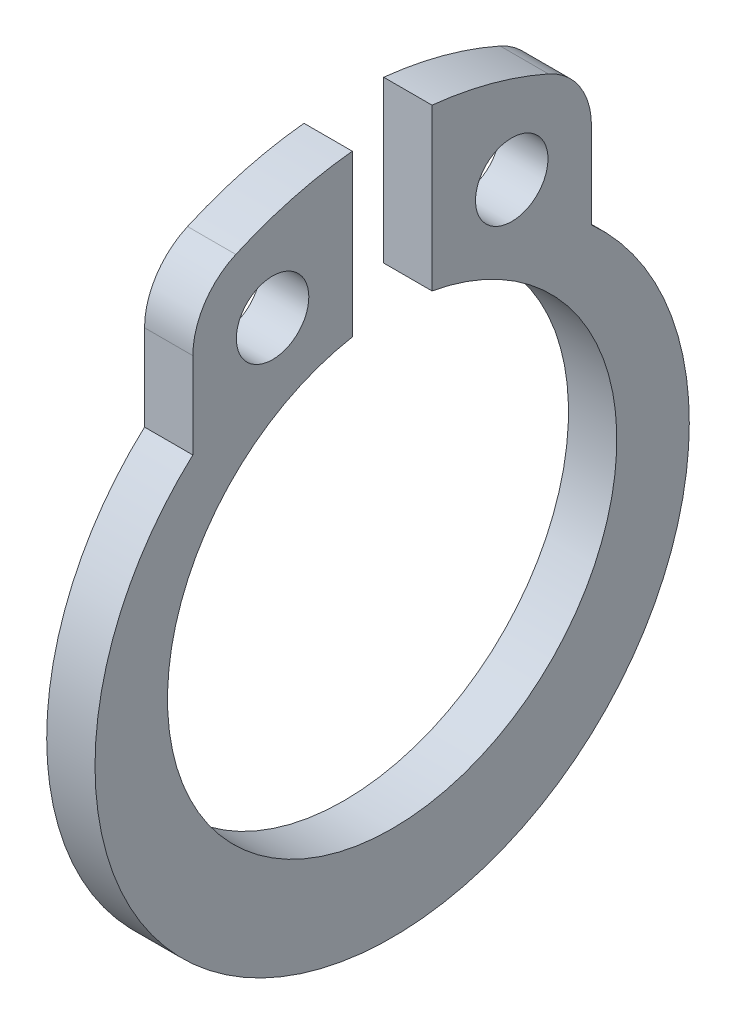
from build123d import *

# Parameters (mm, degrees)
ESQUISSE1_R        = 0.75
BOSS_EXTRU_1_DEPTH = 1


with BuildPart() as part:
    # Esquisse1 → Boss.-Extru.1 (new body)
    with BuildSketch(Plane(origin=(0, 0, 0), x_dir=(0, -1, 0), z_dir=(-1, 0, 0))):
        with BuildLine():
            Line((-7.907077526, 0.825), (-4.576229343, 0.825))
            ThreePointArc((-4.576229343, 0.825), (4.65, 0), (-4.576229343, -0.825))
            Line((-4.576229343, -0.825), (-7.907077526, -0.825))
            ThreePointArc((-7.907077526, -0.825), (-7.679620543, -2.055706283), (-7.261836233, -3.235465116))
            ThreePointArc((-7.261836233, -3.235465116), (-6.708471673, -3.883113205), (-5.891678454, -4.125))
            Line((-5.891678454, -4.125), (-4.11145536, -4.125))
            ThreePointArc((-4.11145536, -4.125), (6.6, 0), (-4.11145536, 4.125))
            Line((-4.11145536, 4.125), (-5.891678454, 4.125))
            ThreePointArc((-5.891678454, 4.125), (-6.708471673, 3.883113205), (-7.261836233, 3.235465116))
            ThreePointArc((-7.261836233, 3.235465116), (-7.679620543, 2.055706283), (-7.907077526, 0.825))
        make_face()
        with Locations(Location((-5.745765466, -2.475, 0), (0, 0, 270))):
            Circle(ESQUISSE1_R, mode=Mode.SUBTRACT)
        with Locations(Location((-5.745765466, 2.475, 0), (0, 0, 270))):
            Circle(ESQUISSE1_R, mode=Mode.SUBTRACT)
    extrude(amount=-BOSS_EXTRU_1_DEPTH)


solid = part.part
